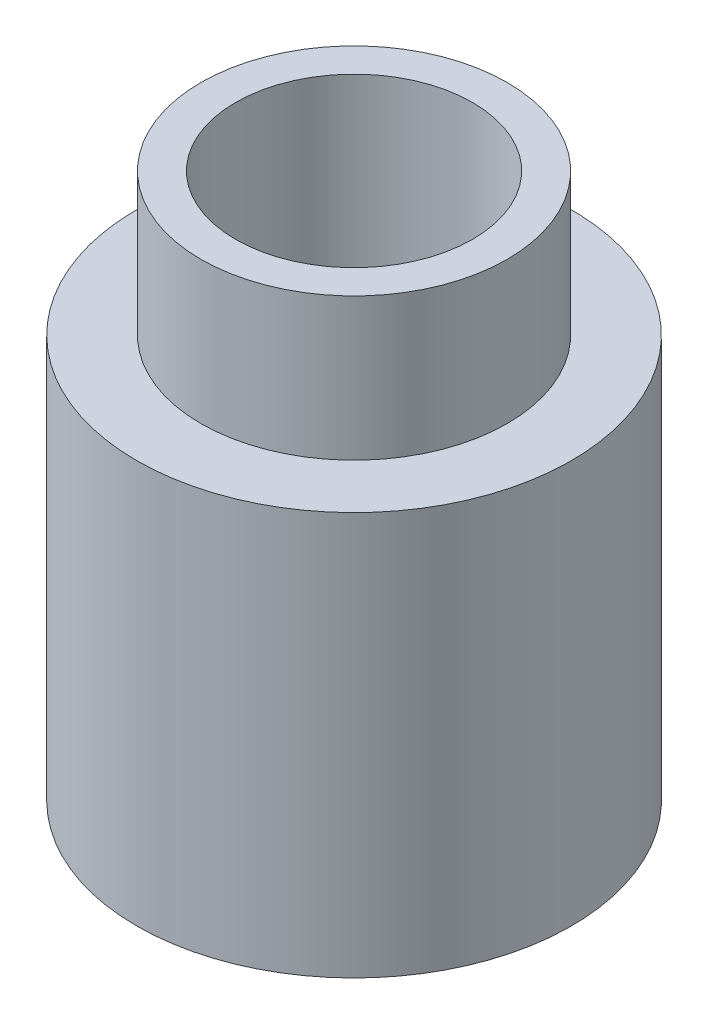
ISO-10303-21;
HEADER;
FILE_DESCRIPTION(('STEP AP214'),'2;1');
FILE_NAME('part.step','',(''),(''),'','','');
FILE_SCHEMA(('AUTOMOTIVE_DESIGN { 1 0 10303 214 1 1 1 1 }'));
ENDSEC;
DATA;
#1=APPLICATION_CONTEXT('core data for automotive mechanical design processes');
#2=APPLICATION_PROTOCOL_DEFINITION('international standard','automotive_design',2000,#1);
#3=PRODUCT_CONTEXT('',#1,'mechanical');
#4=PRODUCT('Part','Part','',(#3));
#5=PRODUCT_RELATED_PRODUCT_CATEGORY('part','',(#4));
#6=PRODUCT_DEFINITION_FORMATION('','',#4);
#7=PRODUCT_DEFINITION_CONTEXT('part definition',#1,'design');
#8=PRODUCT_DEFINITION('design','',#6,#7);
#9=PRODUCT_DEFINITION_SHAPE('','',#8);
#10=(LENGTH_UNIT() NAMED_UNIT(*) SI_UNIT(.MILLI.,.METRE.));
#11=(NAMED_UNIT(*) PLANE_ANGLE_UNIT() SI_UNIT($,.RADIAN.));
#12=(NAMED_UNIT(*) SI_UNIT($,.STERADIAN.) SOLID_ANGLE_UNIT());
#13=UNCERTAINTY_MEASURE_WITH_UNIT(LENGTH_MEASURE(1.E-05),#10,'distance_accuracy_value','');
#14=(GEOMETRIC_REPRESENTATION_CONTEXT(3) GLOBAL_UNCERTAINTY_ASSIGNED_CONTEXT((#13)) GLOBAL_UNIT_ASSIGNED_CONTEXT((#10,
#11,#12)) REPRESENTATION_CONTEXT('',''));
#15=CARTESIAN_POINT('',(0.,0.,0.));
#16=DIRECTION('',(0.,0.,1.));
#17=DIRECTION('',(1.,0.,0.));
#18=AXIS2_PLACEMENT_3D('',#15,#16,#17);
#19=CARTESIAN_POINT('',(41.6649122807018,241.04689122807,-1.88196154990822E-12));
#20=DIRECTION('',(0.,-1.,0.));
#21=DIRECTION('',(0.,0.,-1.));
#22=AXIS2_PLACEMENT_3D('',#19,#20,#21);
#23=CYLINDRICAL_SURFACE('',#22,10.795);
#24=CARTESIAN_POINT('',(41.6649122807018,246.53329122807,-1.88196154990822E-12));
#25=DIRECTION('',(0.,-1.,0.));
#26=DIRECTION('',(0.,0.,-1.));
#27=AXIS2_PLACEMENT_3D('',#24,#25,#26);
#28=CIRCLE('',#27,10.795);
#29=CARTESIAN_POINT('',(41.6649122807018,246.53329122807,-10.7950000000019));
#30=VERTEX_POINT('',#29);
#31=EDGE_CURVE('E78',#30,#30,#28,.T.);
#32=ORIENTED_EDGE('',*,*,#31,.T.);
#33=EDGE_LOOP('',(#32));
#34=FACE_BOUND('',#33,.T.);
#35=CARTESIAN_POINT('',(41.6649122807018,269.43774122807,-1.88196154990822E-12));
#36=DIRECTION('',(0.,1.,0.));
#37=DIRECTION('',(-1.,0.,0.));
#38=AXIS2_PLACEMENT_3D('',#35,#36,#37);
#39=CIRCLE('',#38,10.795);
#40=CARTESIAN_POINT('',(30.8699122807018,269.43774122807,-1.88196154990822E-12));
#41=VERTEX_POINT('',#40);
#42=EDGE_CURVE('E97',#41,#41,#39,.F.);
#43=ORIENTED_EDGE('',*,*,#42,.F.);
#44=EDGE_LOOP('',(#43));
#45=FACE_BOUND('',#44,.T.);
#46=ADVANCED_FACE('F44',(#34,#45),#23,.F.);
#47=CARTESIAN_POINT('',(41.6649122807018,242.612525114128,-1.88196154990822E-12));
#48=DIRECTION('',(0.,-1.,0.));
#49=DIRECTION('',(0.,0.,-1.));
#50=AXIS2_PLACEMENT_3D('',#47,#48,#49);
#51=CONICAL_SURFACE('',#50,11.8455661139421,0.26179938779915);
#52=ORIENTED_EDGE('',*,*,#31,.F.);
#53=EDGE_LOOP('',(#52));
#54=FACE_BOUND('',#53,.T.);
#55=CARTESIAN_POINT('',(41.6649122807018,242.612525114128,-1.88196154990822E-12));
#56=DIRECTION('',(0.,-1.,0.));
#57=DIRECTION('',(0.,0.,-1.));
#58=AXIS2_PLACEMENT_3D('',#55,#56,#57);
#59=CIRCLE('',#58,11.8455661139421);
#60=CARTESIAN_POINT('',(41.6649122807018,242.612525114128,-11.845566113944));
#61=VERTEX_POINT('',#60);
#62=EDGE_CURVE('E82',#61,#61,#59,.T.);
#63=ORIENTED_EDGE('',*,*,#62,.T.);
#64=EDGE_LOOP('',(#63));
#65=FACE_BOUND('',#64,.T.);
#66=ADVANCED_FACE('F105',(#54,#65),#51,.F.);
#67=CARTESIAN_POINT('',(41.6649122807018,241.04689122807,-1.88196154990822E-12));
#68=DIRECTION('',(0.,-1.,0.));
#69=DIRECTION('',(0.,0.,-1.));
#70=AXIS2_PLACEMENT_3D('',#67,#68,#69);
#71=CONICAL_SURFACE('',#70,13.4112,0.78539816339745);
#72=ORIENTED_EDGE('',*,*,#62,.F.);
#73=EDGE_LOOP('',(#72));
#74=FACE_BOUND('',#73,.T.);
#75=CARTESIAN_POINT('',(41.6649122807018,241.04689122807,-1.88196154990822E-12));
#76=DIRECTION('',(0.,-1.,0.));
#77=DIRECTION('',(0.,0.,-1.));
#78=AXIS2_PLACEMENT_3D('',#75,#76,#77);
#79=CIRCLE('',#78,13.4112);
#80=CARTESIAN_POINT('',(41.6649122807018,241.04689122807,-13.4112000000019));
#81=VERTEX_POINT('',#80);
#82=EDGE_CURVE('E86',#81,#81,#79,.F.);
#83=ORIENTED_EDGE('',*,*,#82,.F.);
#84=EDGE_LOOP('',(#83));
#85=FACE_BOUND('',#84,.T.);
#86=ADVANCED_FACE('F111',(#74,#85),#71,.F.);
#87=CARTESIAN_POINT('',(41.6649122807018,241.04689122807,-1.88196154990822E-12));
#88=DIRECTION('',(0.,-1.,0.));
#89=DIRECTION('',(0.,0.,-1.));
#90=AXIS2_PLACEMENT_3D('',#87,#88,#89);
#91=PLANE('',#90);
#92=CARTESIAN_POINT('',(41.6649122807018,241.04689122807,-1.88257397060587E-12));
#93=DIRECTION('',(0.,-1.,0.));
#94=DIRECTION('',(0.,0.,-1.));
#95=AXIS2_PLACEMENT_3D('',#92,#93,#94);
#96=CIRCLE('',#95,14.0716);
#97=CARTESIAN_POINT('',(41.6649122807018,241.04689122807,-14.0716000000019));
#98=VERTEX_POINT('',#97);
#99=EDGE_CURVE('E90',#98,#98,#96,.F.);
#100=ORIENTED_EDGE('',*,*,#99,.F.);
#101=EDGE_LOOP('',(#100));
#102=FACE_BOUND('',#101,.T.);
#103=ORIENTED_EDGE('',*,*,#82,.T.);
#104=EDGE_LOOP('',(#103));
#105=FACE_BOUND('',#104,.T.);
#106=ADVANCED_FACE('F141',(#102,#105),#91,.T.);
#107=CARTESIAN_POINT('',(55.7365122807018,240.22774122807,-1.86870553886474E-12));
#108=DIRECTION('',(0.,1.,0.));
#109=DIRECTION('',(0.,0.,1.));
#110=AXIS2_PLACEMENT_3D('',#107,#108,#109);
#111=PLANE('',#110);
#112=CARTESIAN_POINT('',(41.6649122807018,240.22774122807,-1.88258332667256E-12));
#113=DIRECTION('',(0.,1.,0.));
#114=DIRECTION('',(0.,0.,1.));
#115=AXIS2_PLACEMENT_3D('',#112,#113,#114);
#116=CIRCLE('',#115,14.0716);
#117=CARTESIAN_POINT('',(41.6649122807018,240.22774122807,14.0715999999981));
#118=VERTEX_POINT('',#117);
#119=EDGE_CURVE('E74',#118,#118,#116,.T.);
#120=ORIENTED_EDGE('',*,*,#119,.T.);
#121=EDGE_LOOP('',(#120));
#122=FACE_BOUND('',#121,.T.);
#123=CARTESIAN_POINT('',(41.6649122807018,240.22774122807,-1.88258332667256E-12));
#124=DIRECTION('',(0.,1.,0.));
#125=DIRECTION('',(0.,0.,1.));
#126=AXIS2_PLACEMENT_3D('',#123,#124,#125);
#127=CIRCLE('',#126,17.4625);
#128=CARTESIAN_POINT('',(41.6649122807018,240.22774122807,17.4624999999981));
#129=VERTEX_POINT('',#128);
#130=EDGE_CURVE('E11',#129,#129,#127,.T.);
#131=ORIENTED_EDGE('',*,*,#130,.F.);
#132=EDGE_LOOP('',(#131));
#133=FACE_BOUND('',#132,.T.);
#134=ADVANCED_FACE('F46',(#122,#133),#111,.F.);
#135=CARTESIAN_POINT('',(41.6649122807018,302.710460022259,-1.88258332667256E-12));
#136=DIRECTION('',(0.,1.,0.));
#137=DIRECTION('',(0.,0.,1.));
#138=AXIS2_PLACEMENT_3D('',#135,#136,#137);
#139=CYLINDRICAL_SURFACE('',#138,17.4625);
#140=CARTESIAN_POINT('',(41.6649122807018,272.61274122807,-1.88258332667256E-12));
#141=DIRECTION('',(0.,1.,0.));
#142=DIRECTION('',(0.,0.,1.));
#143=AXIS2_PLACEMENT_3D('',#140,#141,#142);
#144=CIRCLE('',#143,17.4625);
#145=CARTESIAN_POINT('',(41.6649122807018,272.61274122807,17.4624999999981));
#146=VERTEX_POINT('',#145);
#147=EDGE_CURVE('E52',#146,#146,#144,.T.);
#148=ORIENTED_EDGE('',*,*,#147,.F.);
#149=EDGE_LOOP('',(#148));
#150=FACE_BOUND('',#149,.T.);
#151=ORIENTED_EDGE('',*,*,#130,.T.);
#152=EDGE_LOOP('',(#151));
#153=FACE_BOUND('',#152,.T.);
#154=ADVANCED_FACE('F134',(#150,#153),#139,.T.);
#155=CARTESIAN_POINT('',(56.6515399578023,272.61274122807,-1.88258332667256E-12));
#156=DIRECTION('',(0.,-1.,0.));
#157=DIRECTION('',(0.,0.,-1.));
#158=AXIS2_PLACEMENT_3D('',#155,#156,#157);
#159=PLANE('',#158);
#160=CARTESIAN_POINT('',(41.6649122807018,272.61274122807,-1.88258332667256E-12));
#161=DIRECTION('',(0.,1.,0.));
#162=DIRECTION('',(0.,0.,1.));
#163=AXIS2_PLACEMENT_3D('',#160,#161,#162);
#164=CIRCLE('',#163,12.3063);
#165=CARTESIAN_POINT('',(41.6649122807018,272.61274122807,12.3062999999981));
#166=VERTEX_POINT('',#165);
#167=EDGE_CURVE('E58',#166,#166,#164,.T.);
#168=ORIENTED_EDGE('',*,*,#167,.F.);
#169=EDGE_LOOP('',(#168));
#170=FACE_BOUND('',#169,.T.);
#171=ORIENTED_EDGE('',*,*,#147,.T.);
#172=EDGE_LOOP('',(#171));
#173=FACE_BOUND('',#172,.T.);
#174=ADVANCED_FACE('F131',(#170,#173),#159,.F.);
#175=CARTESIAN_POINT('',(41.6649122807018,302.710460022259,-1.88258332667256E-12));
#176=DIRECTION('',(0.,1.,0.));
#177=DIRECTION('',(0.,0.,1.));
#178=AXIS2_PLACEMENT_3D('',#175,#176,#177);
#179=CYLINDRICAL_SURFACE('',#178,12.3063);
#180=CARTESIAN_POINT('',(41.6649122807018,284.04274122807,-1.88258332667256E-12));
#181=DIRECTION('',(0.,1.,0.));
#182=DIRECTION('',(0.,0.,1.));
#183=AXIS2_PLACEMENT_3D('',#180,#181,#182);
#184=CIRCLE('',#183,12.3063);
#185=CARTESIAN_POINT('',(41.6649122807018,284.04274122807,12.3062999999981));
#186=VERTEX_POINT('',#185);
#187=EDGE_CURVE('E64',#186,#186,#184,.T.);
#188=ORIENTED_EDGE('',*,*,#187,.F.);
#189=EDGE_LOOP('',(#188));
#190=FACE_BOUND('',#189,.T.);
#191=ORIENTED_EDGE('',*,*,#167,.T.);
#192=EDGE_LOOP('',(#191));
#193=FACE_BOUND('',#192,.T.);
#194=ADVANCED_FACE('F127',(#190,#193),#179,.T.);
#195=CARTESIAN_POINT('',(51.1899122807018,284.04274122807,-1.88258332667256E-12));
#196=DIRECTION('',(0.,-1.,0.));
#197=DIRECTION('',(0.,0.,-1.));
#198=AXIS2_PLACEMENT_3D('',#195,#196,#197);
#199=PLANE('',#198);
#200=CARTESIAN_POINT('',(41.6649122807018,284.04274122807,-1.88258332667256E-12));
#201=DIRECTION('',(0.,1.,0.));
#202=DIRECTION('',(0.,0.,1.));
#203=AXIS2_PLACEMENT_3D('',#200,#201,#202);
#204=CIRCLE('',#203,9.525);
#205=CARTESIAN_POINT('',(41.6649122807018,284.04274122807,9.52499999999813));
#206=VERTEX_POINT('',#205);
#207=EDGE_CURVE('E70',#206,#206,#204,.T.);
#208=ORIENTED_EDGE('',*,*,#207,.F.);
#209=EDGE_LOOP('',(#208));
#210=FACE_BOUND('',#209,.T.);
#211=ORIENTED_EDGE('',*,*,#187,.T.);
#212=EDGE_LOOP('',(#211));
#213=FACE_BOUND('',#212,.T.);
#214=ADVANCED_FACE('F123',(#210,#213),#199,.F.);
#215=CARTESIAN_POINT('',(41.6649122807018,302.710460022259,-1.88258332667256E-12));
#216=DIRECTION('',(0.,1.,0.));
#217=DIRECTION('',(0.,0.,1.));
#218=AXIS2_PLACEMENT_3D('',#215,#216,#217);
#219=CYLINDRICAL_SURFACE('',#218,9.525);
#220=CARTESIAN_POINT('',(41.6649122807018,269.43774122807,-1.8829633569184E-12));
#221=DIRECTION('',(0.,1.,0.));
#222=DIRECTION('',(-1.,0.,0.));
#223=AXIS2_PLACEMENT_3D('',#220,#221,#222);
#224=CIRCLE('',#223,9.525);
#225=CARTESIAN_POINT('',(32.1399122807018,269.43774122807,-1.8829633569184E-12));
#226=VERTEX_POINT('',#225);
#227=EDGE_CURVE('E93',#226,#226,#224,.F.);
#228=ORIENTED_EDGE('',*,*,#227,.T.);
#229=EDGE_LOOP('',(#228));
#230=FACE_BOUND('',#229,.T.);
#231=ORIENTED_EDGE('',*,*,#207,.T.);
#232=EDGE_LOOP('',(#231));
#233=FACE_BOUND('',#232,.T.);
#234=ADVANCED_FACE('F119',(#230,#233),#219,.F.);
#235=CARTESIAN_POINT('',(41.6649122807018,302.710460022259,-1.88258332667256E-12));
#236=DIRECTION('',(0.,1.,0.));
#237=DIRECTION('',(0.,0.,1.));
#238=AXIS2_PLACEMENT_3D('',#235,#236,#237);
#239=CYLINDRICAL_SURFACE('',#238,14.0716);
#240=ORIENTED_EDGE('',*,*,#119,.F.);
#241=EDGE_LOOP('',(#240));
#242=FACE_BOUND('',#241,.T.);
#243=ORIENTED_EDGE('',*,*,#99,.T.);
#244=EDGE_LOOP('',(#243));
#245=FACE_BOUND('',#244,.T.);
#246=ADVANCED_FACE('F116',(#242,#245),#239,.F.);
#247=CARTESIAN_POINT('',(41.6649122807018,269.43774122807,-1.88258332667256E-12));
#248=DIRECTION('',(0.,1.,0.));
#249=DIRECTION('',(-1.,0.,0.));
#250=AXIS2_PLACEMENT_3D('',#247,#248,#249);
#251=PLANE('',#250);
#252=ORIENTED_EDGE('',*,*,#42,.T.);
#253=EDGE_LOOP('',(#252));
#254=FACE_BOUND('',#253,.T.);
#255=ORIENTED_EDGE('',*,*,#227,.F.);
#256=EDGE_LOOP('',(#255));
#257=FACE_BOUND('',#256,.T.);
#258=ADVANCED_FACE('F101',(#254,#257),#251,.F.);
#259=CLOSED_SHELL('',(#46,#66,#86,#106,#134,#154,#174,#194,#214,#234,#246,#258));
#260=MANIFOLD_SOLID_BREP('B2',#259);
#261=ADVANCED_BREP_SHAPE_REPRESENTATION('',(#18,#260),#14);
#262=SHAPE_DEFINITION_REPRESENTATION(#9,#261);
ENDSEC;
END-ISO-10303-21;
